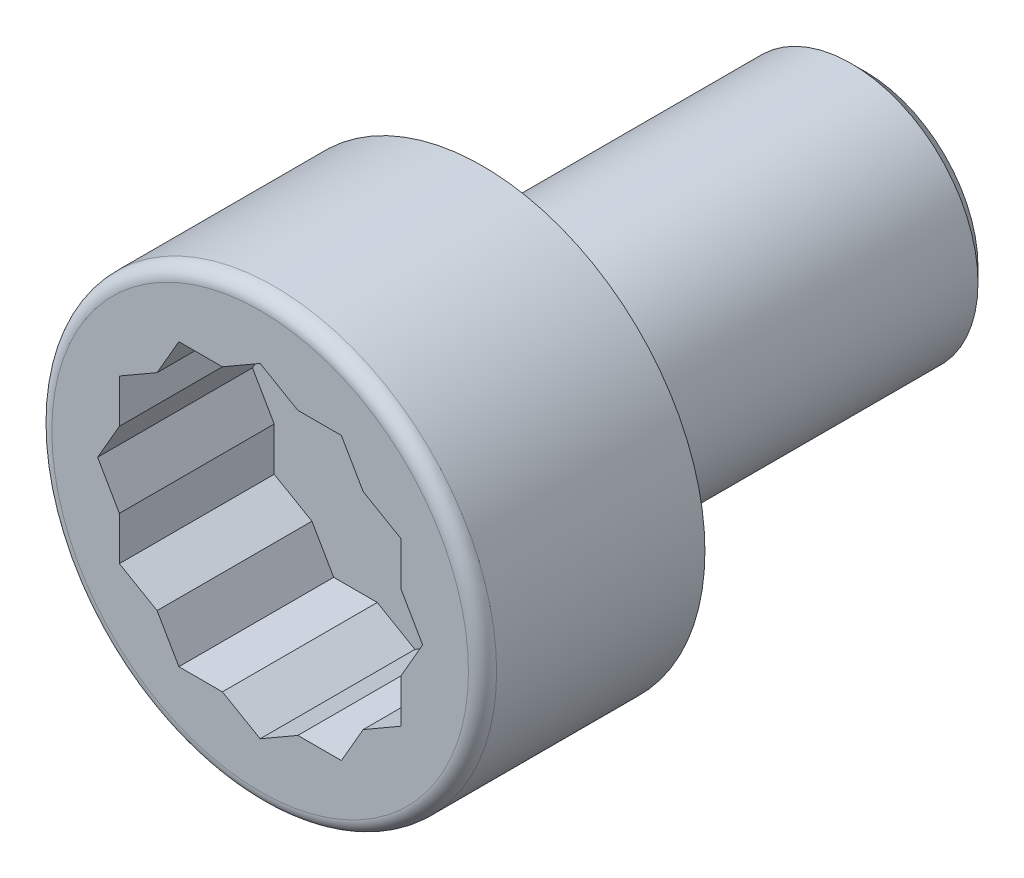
from build123d import *

# Parameters (mm, degrees)
ENL_V_MAT_EXTRU_1_DEPTH      = 5.5
R_P_TITION_CIRCULAIRE1_COUNT = 2
R_P_TITION_CIRCULAIRE1_ANGLE = 30
TROU_TARAUD_M61_D            = 5
CHANFREIN1_SIZE              = 0.5
CONG_1_R                     = 0.5


with BuildPart() as part:
    # Esquisse1 → R_volution1 (revolve)
    with BuildSketch(Plane(origin=(0, 0, 0), x_dir=(0, 0, -1), z_dir=(1, 0, 0)), mode=Mode.PRIVATE) as r_volution1_sk:
        Polygon((0, 0), (21.5, 0), (21.5, 4.5), (7.9, 4.5), (7.9, 7.9), (0, 7.9), align=None)
    revolve(r_volution1_sk.sketch.rotate(Axis((0, 0, 0), (0, 0, -1)), 90), axis=Axis((0, 0, 0), (0, 0, -1)))

    # Esquisse2 → Enl_v. mat.-Extru.1 (cut)
    with BuildSketch(Plane.XY):
        Polygon((0, 5.773502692), (-5, 2.886751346), (-5, -2.886751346), (0, -5.773502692), (5, -2.886751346), (5, 2.886751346), align=None)
    enl_v_mat_extru_1 = extrude(amount=-ENL_V_MAT_EXTRU_1_DEPTH, mode=Mode.SUBTRACT)

    # R_p_tition circulaire1: Enl_v. mat.-Extru.1 ×2 about axis
    r_p_tition_circulaire1_axis = Axis((0, 0, 0), (0, 0, 1))
    for i in range(1, R_P_TITION_CIRCULAIRE1_COUNT):
        add(enl_v_mat_extru_1.rotate(r_p_tition_circulaire1_axis, i * R_P_TITION_CIRCULAIRE1_ANGLE / (R_P_TITION_CIRCULAIRE1_COUNT - 1)), mode=Mode.SUBTRACT)

    # Trou taraud_ M61 (through all)
    with Locations(Plane.XY):
        with Locations((0, 0)):
            Hole(TROU_TARAUD_M61_D / 2)

    # Chanfrein1
    chanfrein1_edges = [part.edges().sort_by_distance(p)[0] for p in [
        (-4.5, 0, -21.5),
    ]]
    chamfer(chanfrein1_edges, length=CHANFREIN1_SIZE)

    # Cong_1
    cong_1_edges = [part.edges().sort_by_distance(p)[0] for p in [
        (-7.9, 0, 0),
    ]]
    fillet(cong_1_edges, radius=CONG_1_R)


solid = part.part
